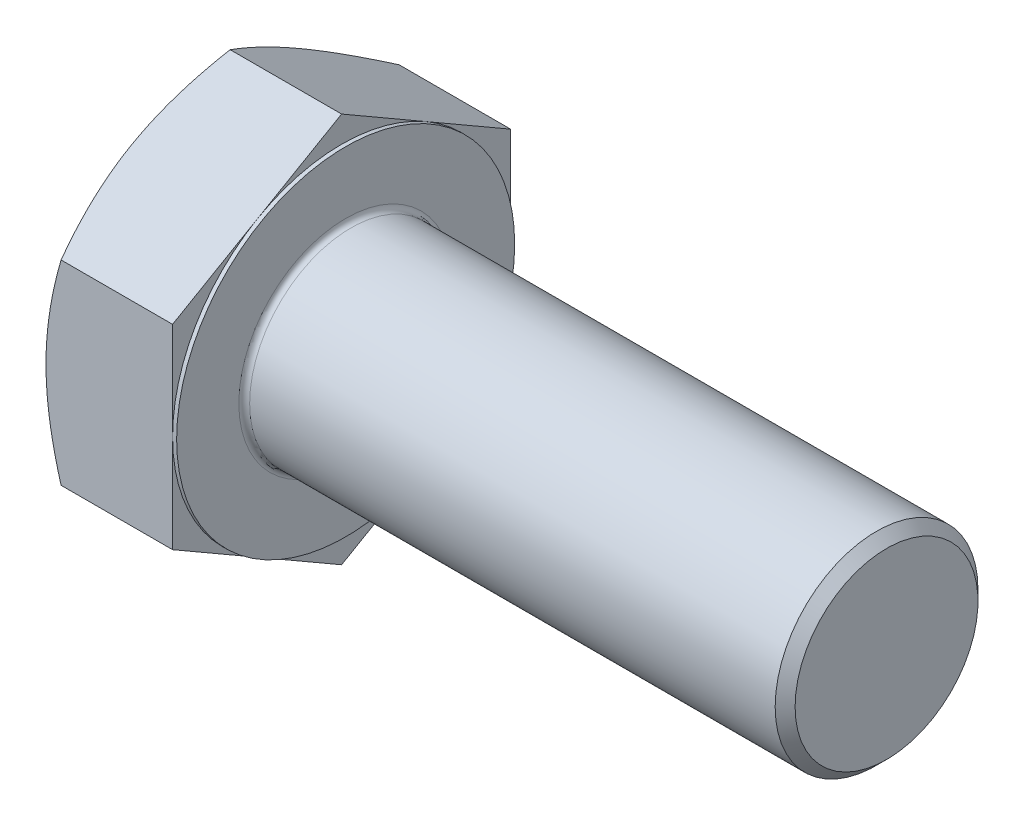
from build123d import *

# Parameters (mm, degrees)
BASEHEAD_DEPTH = 12.2682
SKETCH4_W      = 0.381
SKETCH4_H      = 27.855871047
HEADFILLET_R   = 0.508


with BuildPart() as part:
    # Sketch1 → BaseHead (new body)
    with BuildSketch(Plane(origin=(0, 0, 0), x_dir=(0, 0, -1), z_dir=(1, 0, 0))):
        Polygon((15.875, 9.165435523), (15.875, -9.165435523), (0, -18.330871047), (-15.875, -9.165435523), (-15.875, 9.165435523), (0, 18.330871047), align=None)
    extrude(amount=BASEHEAD_DEPTH)

    # BodySke → BaseBody (revolve)
    with BuildSketch(Plane.XY, mode=Mode.PRIVATE) as basebody_sk:
        Polygon((0, 0), (63.0682, 0), (63.0682, 8.58901), (62.13221, 9.525), (0, 9.525), align=None)
    revolve(basebody_sk.sketch.rotate(Axis((0, 0, 0), (1, 0, 0)), 90), axis=Axis((0, 0, 0), (1, 0, 0)))

    # Sketch3 → HeadChamfer (revolve, cut)
    with BuildSketch(Plane.XY):
        Polygon((0, 15.875), (5.084072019, 24.680871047), (5.084072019, 31.030871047), (-12.7, 31.030871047), (-12.7, 15.875), align=None)
    revolve(axis=Axis((0, 0, 0), (1, 0, 0)), mode=Mode.SUBTRACT)

    # Sketch4 → BearingFace (revolve, cut)
    with BuildSketch(Plane.XY, mode=Mode.PRIVATE) as bearingface_sk:
        with Locations((12.0777, 29.802935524)):
            Rectangle(SKETCH4_W, SKETCH4_H)
    revolve(bearingface_sk.sketch.rotate(Axis((0, 0, 0), (1, 0, 0)), 270), axis=Axis((0, 0, 0), (1, 0, 0)), mode=Mode.SUBTRACT)

    # HeadFillet
    headfillet_edges = [part.edges().sort_by_distance(p)[0] for p in [
        (12.2682, 0, -9.525),
    ]]
    fillet(headfillet_edges, radius=HEADFILLET_R)


solid = part.part
